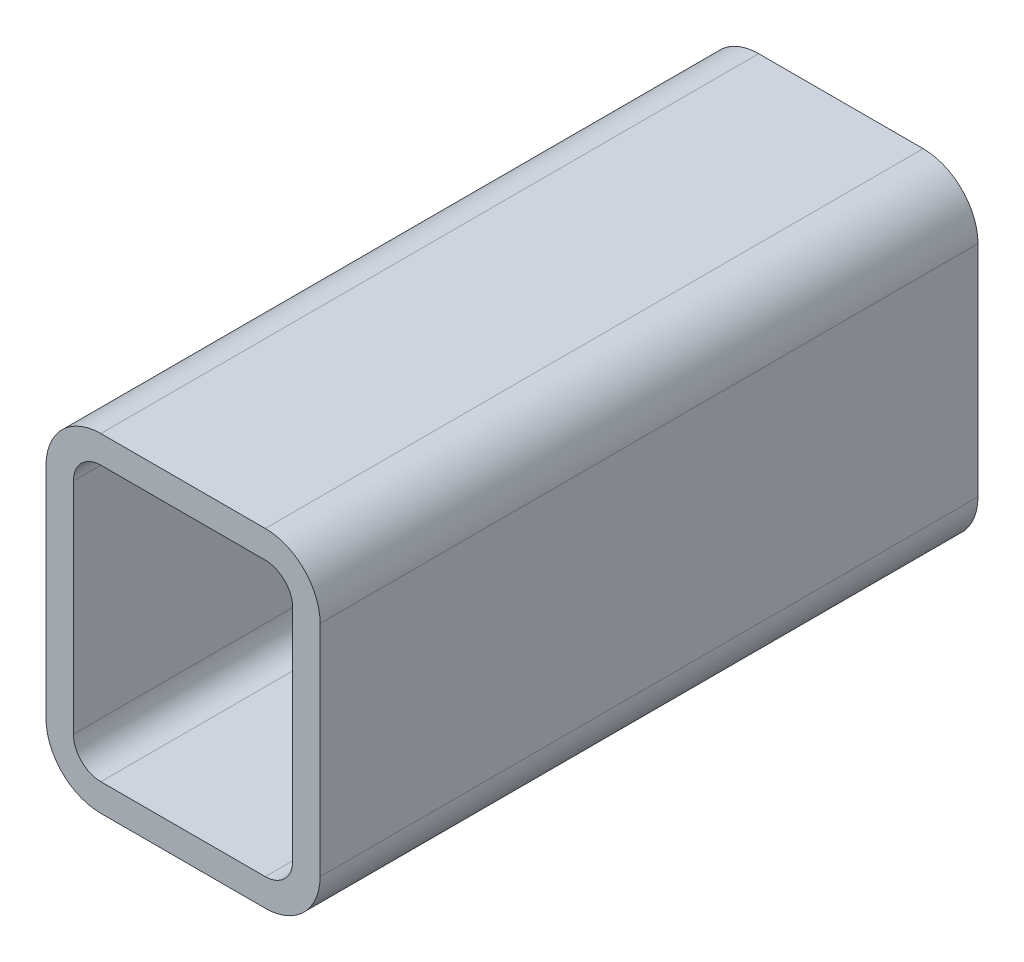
ISO-10303-21;
HEADER;
FILE_DESCRIPTION(('STEP AP214'),'2;1');
FILE_NAME('part.step','',(''),(''),'','','');
FILE_SCHEMA(('AUTOMOTIVE_DESIGN { 1 0 10303 214 1 1 1 1 }'));
ENDSEC;
DATA;
#1=APPLICATION_CONTEXT('core data for automotive mechanical design processes');
#2=APPLICATION_PROTOCOL_DEFINITION('international standard','automotive_design',2000,#1);
#3=PRODUCT_CONTEXT('',#1,'mechanical');
#4=PRODUCT('Part','Part','',(#3));
#5=PRODUCT_RELATED_PRODUCT_CATEGORY('part','',(#4));
#6=PRODUCT_DEFINITION_FORMATION('','',#4);
#7=PRODUCT_DEFINITION_CONTEXT('part definition',#1,'design');
#8=PRODUCT_DEFINITION('design','',#6,#7);
#9=PRODUCT_DEFINITION_SHAPE('','',#8);
#10=(LENGTH_UNIT() NAMED_UNIT(*) SI_UNIT(.MILLI.,.METRE.));
#11=(NAMED_UNIT(*) PLANE_ANGLE_UNIT() SI_UNIT($,.RADIAN.));
#12=(NAMED_UNIT(*) SI_UNIT($,.STERADIAN.) SOLID_ANGLE_UNIT());
#13=UNCERTAINTY_MEASURE_WITH_UNIT(LENGTH_MEASURE(1.E-05),#10,'distance_accuracy_value','');
#14=(GEOMETRIC_REPRESENTATION_CONTEXT(3) GLOBAL_UNCERTAINTY_ASSIGNED_CONTEXT((#13)) GLOBAL_UNIT_ASSIGNED_CONTEXT((#10,
#11,#12)) REPRESENTATION_CONTEXT('',''));
#15=CARTESIAN_POINT('',(0.,0.,0.));
#16=DIRECTION('',(0.,0.,1.));
#17=DIRECTION('',(1.,0.,0.));
#18=AXIS2_PLACEMENT_3D('',#15,#16,#17);
#19=CARTESIAN_POINT('',(26.2612396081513,129.011948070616,304.8));
#20=DIRECTION('',(0.,0.,1.));
#21=DIRECTION('',(1.,0.,0.));
#22=AXIS2_PLACEMENT_3D('',#19,#20,#21);
#23=PLANE('',#22);
#24=CARTESIAN_POINT('',(26.2612396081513,129.011948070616,304.8));
#25=DIRECTION('',(0.,0.,1.));
#26=DIRECTION('',(1.,0.,0.));
#27=AXIS2_PLACEMENT_3D('',#24,#25,#26);
#28=CIRCLE('',#27,25.4);
#29=CARTESIAN_POINT('',(26.2612396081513,154.411948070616,304.8));
#30=VERTEX_POINT('',#29);
#31=CARTESIAN_POINT('',(0.8612396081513,129.011948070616,304.8));
#32=VERTEX_POINT('',#31);
#33=EDGE_CURVE('E211',#30,#32,#28,.T.);
#34=ORIENTED_EDGE('',*,*,#33,.T.);
#35=DIRECTION('',(0.,-1.,0.));
#36=VECTOR('',#35,1.);
#37=CARTESIAN_POINT('',(0.8612396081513,27.4119480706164,304.8));
#38=LINE('',#37,#36);
#39=CARTESIAN_POINT('',(0.861239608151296,27.4119480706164,304.8));
#40=VERTEX_POINT('',#39);
#41=EDGE_CURVE('E214',#32,#40,#38,.T.);
#42=ORIENTED_EDGE('',*,*,#41,.T.);
#43=CARTESIAN_POINT('',(26.2612396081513,27.4119480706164,304.8));
#44=DIRECTION('',(0.,0.,1.));
#45=DIRECTION('',(1.,0.,0.));
#46=AXIS2_PLACEMENT_3D('',#43,#44,#45);
#47=CIRCLE('',#46,25.4);
#48=CARTESIAN_POINT('',(26.2612396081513,2.01194807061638,304.8));
#49=VERTEX_POINT('',#48);
#50=EDGE_CURVE('E217',#40,#49,#47,.T.);
#51=ORIENTED_EDGE('',*,*,#50,.T.);
#52=DIRECTION('',(1.,0.,0.));
#53=VECTOR('',#52,1.);
#54=CARTESIAN_POINT('',(102.461239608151,2.01194807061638,304.8));
#55=LINE('',#54,#53);
#56=CARTESIAN_POINT('',(102.461239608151,2.01194807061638,304.8));
#57=VERTEX_POINT('',#56);
#58=EDGE_CURVE('E219',#49,#57,#55,.T.);
#59=ORIENTED_EDGE('',*,*,#58,.T.);
#60=CARTESIAN_POINT('',(102.461239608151,27.4119480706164,304.8));
#61=DIRECTION('',(0.,0.,1.));
#62=DIRECTION('',(1.,0.,0.));
#63=AXIS2_PLACEMENT_3D('',#60,#61,#62);
#64=CIRCLE('',#63,25.4);
#65=CARTESIAN_POINT('',(127.861239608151,27.4119480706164,304.8));
#66=VERTEX_POINT('',#65);
#67=EDGE_CURVE('E221',#57,#66,#64,.T.);
#68=ORIENTED_EDGE('',*,*,#67,.T.);
#69=DIRECTION('',(0.,1.,0.));
#70=VECTOR('',#69,1.);
#71=CARTESIAN_POINT('',(127.861239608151,129.011948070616,304.8));
#72=LINE('',#71,#70);
#73=CARTESIAN_POINT('',(127.861239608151,129.011948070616,304.8));
#74=VERTEX_POINT('',#73);
#75=EDGE_CURVE('E223',#66,#74,#72,.T.);
#76=ORIENTED_EDGE('',*,*,#75,.T.);
#77=CARTESIAN_POINT('',(102.461239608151,129.011948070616,304.8));
#78=DIRECTION('',(0.,0.,1.));
#79=DIRECTION('',(1.,0.,0.));
#80=AXIS2_PLACEMENT_3D('',#77,#78,#79);
#81=CIRCLE('',#80,25.4);
#82=CARTESIAN_POINT('',(102.461239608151,154.411948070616,304.8));
#83=VERTEX_POINT('',#82);
#84=EDGE_CURVE('E225',#74,#83,#81,.T.);
#85=ORIENTED_EDGE('',*,*,#84,.T.);
#86=DIRECTION('',(-1.,0.,0.));
#87=VECTOR('',#86,1.);
#88=CARTESIAN_POINT('',(26.2612396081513,154.411948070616,304.8));
#89=LINE('',#88,#87);
#90=EDGE_CURVE('E227',#83,#30,#89,.T.);
#91=ORIENTED_EDGE('',*,*,#90,.T.);
#92=EDGE_LOOP('',(#34,#42,#51,#59,#68,#76,#85,#91));
#93=FACE_BOUND('',#92,.T.);
#94=DIRECTION('',(0.,-1.,0.));
#95=VECTOR('',#94,1.);
#96=CARTESIAN_POINT('',(13.5612396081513,27.4119480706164,304.8));
#97=LINE('',#96,#95);
#98=CARTESIAN_POINT('',(13.5612396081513,129.011948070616,304.8));
#99=VERTEX_POINT('',#98);
#100=CARTESIAN_POINT('',(13.5612396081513,27.4119480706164,304.8));
#101=VERTEX_POINT('',#100);
#102=EDGE_CURVE('E154',#99,#101,#97,.T.);
#103=ORIENTED_EDGE('',*,*,#102,.F.);
#104=CARTESIAN_POINT('',(26.2612396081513,129.011948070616,304.8));
#105=DIRECTION('',(0.,0.,1.));
#106=DIRECTION('',(1.,0.,0.));
#107=AXIS2_PLACEMENT_3D('',#104,#105,#106);
#108=CIRCLE('',#107,12.7);
#109=CARTESIAN_POINT('',(26.2612396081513,141.711948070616,304.8));
#110=VERTEX_POINT('',#109);
#111=EDGE_CURVE('E146',#110,#99,#108,.T.);
#112=ORIENTED_EDGE('',*,*,#111,.F.);
#113=DIRECTION('',(-1.,0.,0.));
#114=VECTOR('',#113,1.);
#115=CARTESIAN_POINT('',(26.2612396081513,141.711948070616,304.8));
#116=LINE('',#115,#114);
#117=CARTESIAN_POINT('',(102.461239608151,141.711948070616,304.8));
#118=VERTEX_POINT('',#117);
#119=EDGE_CURVE('E179',#118,#110,#116,.T.);
#120=ORIENTED_EDGE('',*,*,#119,.F.);
#121=CARTESIAN_POINT('',(102.461239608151,129.011948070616,304.8));
#122=DIRECTION('',(0.,0.,1.));
#123=DIRECTION('',(1.,0.,0.));
#124=AXIS2_PLACEMENT_3D('',#121,#122,#123);
#125=CIRCLE('',#124,12.7);
#126=CARTESIAN_POINT('',(115.161239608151,129.011948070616,304.8));
#127=VERTEX_POINT('',#126);
#128=EDGE_CURVE('E177',#127,#118,#125,.T.);
#129=ORIENTED_EDGE('',*,*,#128,.F.);
#130=DIRECTION('',(0.,1.,0.));
#131=VECTOR('',#130,1.);
#132=CARTESIAN_POINT('',(115.161239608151,129.011948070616,304.8));
#133=LINE('',#132,#131);
#134=CARTESIAN_POINT('',(115.161239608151,27.4119480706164,304.8));
#135=VERTEX_POINT('',#134);
#136=EDGE_CURVE('E175',#135,#127,#133,.T.);
#137=ORIENTED_EDGE('',*,*,#136,.F.);
#138=CARTESIAN_POINT('',(102.461239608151,27.4119480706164,304.8));
#139=DIRECTION('',(0.,0.,1.));
#140=DIRECTION('',(1.,0.,0.));
#141=AXIS2_PLACEMENT_3D('',#138,#139,#140);
#142=CIRCLE('',#141,12.7);
#143=CARTESIAN_POINT('',(102.461239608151,14.7119480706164,304.8));
#144=VERTEX_POINT('',#143);
#145=EDGE_CURVE('E173',#144,#135,#142,.T.);
#146=ORIENTED_EDGE('',*,*,#145,.F.);
#147=DIRECTION('',(1.,0.,0.));
#148=VECTOR('',#147,1.);
#149=CARTESIAN_POINT('',(102.461239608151,14.7119480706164,304.8));
#150=LINE('',#149,#148);
#151=CARTESIAN_POINT('',(26.2612396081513,14.7119480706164,304.8));
#152=VERTEX_POINT('',#151);
#153=EDGE_CURVE('E169',#152,#144,#150,.T.);
#154=ORIENTED_EDGE('',*,*,#153,.F.);
#155=CARTESIAN_POINT('',(26.2612396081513,27.4119480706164,304.8));
#156=DIRECTION('',(0.,0.,1.));
#157=DIRECTION('',(1.,0.,0.));
#158=AXIS2_PLACEMENT_3D('',#155,#156,#157);
#159=CIRCLE('',#158,12.7);
#160=EDGE_CURVE('E167',#101,#152,#159,.T.);
#161=ORIENTED_EDGE('',*,*,#160,.F.);
#162=EDGE_LOOP('',(#103,#112,#120,#129,#137,#146,#154,#161));
#163=FACE_BOUND('',#162,.T.);
#164=ADVANCED_FACE('F33',(#93,#163),#23,.T.);
#165=CARTESIAN_POINT('',(26.2612396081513,129.011948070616,0.));
#166=DIRECTION('',(0.,0.,1.));
#167=DIRECTION('',(1.,0.,0.));
#168=AXIS2_PLACEMENT_3D('',#165,#166,#167);
#169=PLANE('',#168);
#170=CARTESIAN_POINT('',(26.2612396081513,129.011948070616,0.));
#171=DIRECTION('',(0.,0.,1.));
#172=DIRECTION('',(1.,0.,0.));
#173=AXIS2_PLACEMENT_3D('',#170,#171,#172);
#174=CIRCLE('',#173,25.4);
#175=CARTESIAN_POINT('',(26.2612396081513,154.411948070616,0.));
#176=VERTEX_POINT('',#175);
#177=CARTESIAN_POINT('',(0.8612396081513,129.011948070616,0.));
#178=VERTEX_POINT('',#177);
#179=EDGE_CURVE('E162',#176,#178,#174,.T.);
#180=ORIENTED_EDGE('',*,*,#179,.F.);
#181=DIRECTION('',(-1.,0.,0.));
#182=VECTOR('',#181,1.);
#183=CARTESIAN_POINT('',(26.2612396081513,154.411948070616,0.));
#184=LINE('',#183,#182);
#185=CARTESIAN_POINT('',(102.461239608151,154.411948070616,0.));
#186=VERTEX_POINT('',#185);
#187=EDGE_CURVE('E215',#186,#176,#184,.T.);
#188=ORIENTED_EDGE('',*,*,#187,.F.);
#189=CARTESIAN_POINT('',(102.461239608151,129.011948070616,0.));
#190=DIRECTION('',(0.,0.,1.));
#191=DIRECTION('',(1.,0.,0.));
#192=AXIS2_PLACEMENT_3D('',#189,#190,#191);
#193=CIRCLE('',#192,25.4);
#194=CARTESIAN_POINT('',(127.861239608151,129.011948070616,0.));
#195=VERTEX_POINT('',#194);
#196=EDGE_CURVE('E242',#195,#186,#193,.T.);
#197=ORIENTED_EDGE('',*,*,#196,.F.);
#198=DIRECTION('',(0.,1.,0.));
#199=VECTOR('',#198,1.);
#200=CARTESIAN_POINT('',(127.861239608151,129.011948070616,0.));
#201=LINE('',#200,#199);
#202=CARTESIAN_POINT('',(127.861239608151,27.4119480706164,0.));
#203=VERTEX_POINT('',#202);
#204=EDGE_CURVE('E240',#203,#195,#201,.T.);
#205=ORIENTED_EDGE('',*,*,#204,.F.);
#206=CARTESIAN_POINT('',(102.461239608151,27.4119480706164,0.));
#207=DIRECTION('',(0.,0.,1.));
#208=DIRECTION('',(1.,0.,0.));
#209=AXIS2_PLACEMENT_3D('',#206,#207,#208);
#210=CIRCLE('',#209,25.4);
#211=CARTESIAN_POINT('',(102.461239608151,2.01194807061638,0.));
#212=VERTEX_POINT('',#211);
#213=EDGE_CURVE('E238',#212,#203,#210,.T.);
#214=ORIENTED_EDGE('',*,*,#213,.F.);
#215=DIRECTION('',(1.,0.,0.));
#216=VECTOR('',#215,1.);
#217=CARTESIAN_POINT('',(102.461239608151,2.01194807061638,0.));
#218=LINE('',#217,#216);
#219=CARTESIAN_POINT('',(26.2612396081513,2.01194807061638,0.));
#220=VERTEX_POINT('',#219);
#221=EDGE_CURVE('E236',#220,#212,#218,.T.);
#222=ORIENTED_EDGE('',*,*,#221,.F.);
#223=CARTESIAN_POINT('',(26.2612396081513,27.4119480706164,0.));
#224=DIRECTION('',(0.,0.,1.));
#225=DIRECTION('',(1.,0.,0.));
#226=AXIS2_PLACEMENT_3D('',#223,#224,#225);
#227=CIRCLE('',#226,25.4);
#228=CARTESIAN_POINT('',(0.861239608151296,27.4119480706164,0.));
#229=VERTEX_POINT('',#228);
#230=EDGE_CURVE('E234',#229,#220,#227,.T.);
#231=ORIENTED_EDGE('',*,*,#230,.F.);
#232=DIRECTION('',(0.,-1.,0.));
#233=VECTOR('',#232,1.);
#234=CARTESIAN_POINT('',(0.8612396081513,27.4119480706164,0.));
#235=LINE('',#234,#233);
#236=EDGE_CURVE('E232',#178,#229,#235,.T.);
#237=ORIENTED_EDGE('',*,*,#236,.F.);
#238=EDGE_LOOP('',(#180,#188,#197,#205,#214,#222,#231,#237));
#239=FACE_BOUND('',#238,.T.);
#240=CARTESIAN_POINT('',(26.2612396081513,129.011948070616,0.));
#241=DIRECTION('',(0.,0.,1.));
#242=DIRECTION('',(1.,0.,0.));
#243=AXIS2_PLACEMENT_3D('',#240,#241,#242);
#244=CIRCLE('',#243,12.7);
#245=CARTESIAN_POINT('',(26.2612396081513,141.711948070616,0.));
#246=VERTEX_POINT('',#245);
#247=CARTESIAN_POINT('',(13.5612396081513,129.011948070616,0.));
#248=VERTEX_POINT('',#247);
#249=EDGE_CURVE('E56',#246,#248,#244,.T.);
#250=ORIENTED_EDGE('',*,*,#249,.T.);
#251=DIRECTION('',(0.,-1.,0.));
#252=VECTOR('',#251,1.);
#253=CARTESIAN_POINT('',(13.5612396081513,27.4119480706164,0.));
#254=LINE('',#253,#252);
#255=CARTESIAN_POINT('',(13.5612396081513,27.4119480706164,0.));
#256=VERTEX_POINT('',#255);
#257=EDGE_CURVE('E161',#248,#256,#254,.T.);
#258=ORIENTED_EDGE('',*,*,#257,.T.);
#259=CARTESIAN_POINT('',(26.2612396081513,27.4119480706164,0.));
#260=DIRECTION('',(0.,0.,1.));
#261=DIRECTION('',(1.,0.,0.));
#262=AXIS2_PLACEMENT_3D('',#259,#260,#261);
#263=CIRCLE('',#262,12.7);
#264=CARTESIAN_POINT('',(26.2612396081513,14.7119480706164,0.));
#265=VERTEX_POINT('',#264);
#266=EDGE_CURVE('E183',#256,#265,#263,.T.);
#267=ORIENTED_EDGE('',*,*,#266,.T.);
#268=DIRECTION('',(1.,0.,0.));
#269=VECTOR('',#268,1.);
#270=CARTESIAN_POINT('',(102.461239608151,14.7119480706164,0.));
#271=LINE('',#270,#269);
#272=CARTESIAN_POINT('',(102.461239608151,14.7119480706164,0.));
#273=VERTEX_POINT('',#272);
#274=EDGE_CURVE('E186',#265,#273,#271,.T.);
#275=ORIENTED_EDGE('',*,*,#274,.T.);
#276=CARTESIAN_POINT('',(102.461239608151,27.4119480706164,0.));
#277=DIRECTION('',(0.,0.,1.));
#278=DIRECTION('',(1.,0.,0.));
#279=AXIS2_PLACEMENT_3D('',#276,#277,#278);
#280=CIRCLE('',#279,12.7);
#281=CARTESIAN_POINT('',(115.161239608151,27.4119480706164,0.));
#282=VERTEX_POINT('',#281);
#283=EDGE_CURVE('E189',#273,#282,#280,.T.);
#284=ORIENTED_EDGE('',*,*,#283,.T.);
#285=DIRECTION('',(0.,1.,0.));
#286=VECTOR('',#285,1.);
#287=CARTESIAN_POINT('',(115.161239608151,129.011948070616,0.));
#288=LINE('',#287,#286);
#289=CARTESIAN_POINT('',(115.161239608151,129.011948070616,0.));
#290=VERTEX_POINT('',#289);
#291=EDGE_CURVE('E192',#282,#290,#288,.T.);
#292=ORIENTED_EDGE('',*,*,#291,.T.);
#293=CARTESIAN_POINT('',(102.461239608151,129.011948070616,0.));
#294=DIRECTION('',(0.,0.,1.));
#295=DIRECTION('',(1.,0.,0.));
#296=AXIS2_PLACEMENT_3D('',#293,#294,#295);
#297=CIRCLE('',#296,12.7);
#298=CARTESIAN_POINT('',(102.461239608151,141.711948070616,0.));
#299=VERTEX_POINT('',#298);
#300=EDGE_CURVE('E195',#290,#299,#297,.T.);
#301=ORIENTED_EDGE('',*,*,#300,.T.);
#302=DIRECTION('',(-1.,0.,0.));
#303=VECTOR('',#302,1.);
#304=CARTESIAN_POINT('',(26.2612396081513,141.711948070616,0.));
#305=LINE('',#304,#303);
#306=EDGE_CURVE('E155',#299,#246,#305,.T.);
#307=ORIENTED_EDGE('',*,*,#306,.T.);
#308=EDGE_LOOP('',(#250,#258,#267,#275,#284,#292,#301,#307));
#309=FACE_BOUND('',#308,.T.);
#310=ADVANCED_FACE('F272',(#239,#309),#169,.F.);
#311=CARTESIAN_POINT('',(26.2612396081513,129.011948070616,304.8));
#312=DIRECTION('',(0.,0.,-1.));
#313=DIRECTION('',(-1.,0.,0.));
#314=AXIS2_PLACEMENT_3D('',#311,#312,#313);
#315=CYLINDRICAL_SURFACE('',#314,25.4);
#316=ORIENTED_EDGE('',*,*,#179,.T.);
#317=DIRECTION('',(0.,0.,-1.));
#318=VECTOR('',#317,1.);
#319=CARTESIAN_POINT('',(0.8612396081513,129.011948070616,304.8));
#320=LINE('',#319,#318);
#321=EDGE_CURVE('E11',#32,#178,#320,.T.);
#322=ORIENTED_EDGE('',*,*,#321,.F.);
#323=ORIENTED_EDGE('',*,*,#33,.F.);
#324=DIRECTION('',(0.,0.,-1.));
#325=VECTOR('',#324,1.);
#326=CARTESIAN_POINT('',(26.2612396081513,154.411948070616,304.8));
#327=LINE('',#326,#325);
#328=EDGE_CURVE('E229',#30,#176,#327,.T.);
#329=ORIENTED_EDGE('',*,*,#328,.T.);
#330=EDGE_LOOP('',(#316,#322,#323,#329));
#331=FACE_BOUND('',#330,.T.);
#332=ADVANCED_FACE('F35',(#331),#315,.T.);
#333=CARTESIAN_POINT('',(0.8612396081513,27.4119480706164,304.8));
#334=DIRECTION('',(1.,0.,0.));
#335=DIRECTION('',(0.,0.,-1.));
#336=AXIS2_PLACEMENT_3D('',#333,#334,#335);
#337=PLANE('',#336);
#338=ORIENTED_EDGE('',*,*,#236,.T.);
#339=DIRECTION('',(0.,0.,-1.));
#340=VECTOR('',#339,1.);
#341=CARTESIAN_POINT('',(0.861239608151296,27.4119480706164,304.8));
#342=LINE('',#341,#340);
#343=EDGE_CURVE('E41',#40,#229,#342,.T.);
#344=ORIENTED_EDGE('',*,*,#343,.F.);
#345=ORIENTED_EDGE('',*,*,#41,.F.);
#346=ORIENTED_EDGE('',*,*,#321,.T.);
#347=EDGE_LOOP('',(#338,#344,#345,#346));
#348=FACE_BOUND('',#347,.T.);
#349=ADVANCED_FACE('F289',(#348),#337,.F.);
#350=CARTESIAN_POINT('',(26.2612396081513,27.4119480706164,304.8));
#351=DIRECTION('',(0.,0.,-1.));
#352=DIRECTION('',(-1.,0.,0.));
#353=AXIS2_PLACEMENT_3D('',#350,#351,#352);
#354=CYLINDRICAL_SURFACE('',#353,25.4);
#355=ORIENTED_EDGE('',*,*,#230,.T.);
#356=DIRECTION('',(0.,0.,-1.));
#357=VECTOR('',#356,1.);
#358=CARTESIAN_POINT('',(26.2612396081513,2.01194807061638,304.8));
#359=LINE('',#358,#357);
#360=EDGE_CURVE('E259',#49,#220,#359,.T.);
#361=ORIENTED_EDGE('',*,*,#360,.F.);
#362=ORIENTED_EDGE('',*,*,#50,.F.);
#363=ORIENTED_EDGE('',*,*,#343,.T.);
#364=EDGE_LOOP('',(#355,#361,#362,#363));
#365=FACE_BOUND('',#364,.T.);
#366=ADVANCED_FACE('F266',(#365),#354,.T.);
#367=CARTESIAN_POINT('',(102.461239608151,2.01194807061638,304.8));
#368=DIRECTION('',(0.,1.,0.));
#369=DIRECTION('',(0.,0.,1.));
#370=AXIS2_PLACEMENT_3D('',#367,#368,#369);
#371=PLANE('',#370);
#372=ORIENTED_EDGE('',*,*,#221,.T.);
#373=DIRECTION('',(0.,0.,-1.));
#374=VECTOR('',#373,1.);
#375=CARTESIAN_POINT('',(102.461239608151,2.01194807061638,304.8));
#376=LINE('',#375,#374);
#377=EDGE_CURVE('E256',#57,#212,#376,.T.);
#378=ORIENTED_EDGE('',*,*,#377,.F.);
#379=ORIENTED_EDGE('',*,*,#58,.F.);
#380=ORIENTED_EDGE('',*,*,#360,.T.);
#381=EDGE_LOOP('',(#372,#378,#379,#380));
#382=FACE_BOUND('',#381,.T.);
#383=ADVANCED_FACE('F278',(#382),#371,.F.);
#384=CARTESIAN_POINT('',(102.461239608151,27.4119480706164,304.8));
#385=DIRECTION('',(0.,0.,-1.));
#386=DIRECTION('',(-1.,0.,0.));
#387=AXIS2_PLACEMENT_3D('',#384,#385,#386);
#388=CYLINDRICAL_SURFACE('',#387,25.4);
#389=ORIENTED_EDGE('',*,*,#213,.T.);
#390=DIRECTION('',(0.,0.,-1.));
#391=VECTOR('',#390,1.);
#392=CARTESIAN_POINT('',(127.861239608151,27.4119480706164,304.8));
#393=LINE('',#392,#391);
#394=EDGE_CURVE('E253',#66,#203,#393,.T.);
#395=ORIENTED_EDGE('',*,*,#394,.F.);
#396=ORIENTED_EDGE('',*,*,#67,.F.);
#397=ORIENTED_EDGE('',*,*,#377,.T.);
#398=EDGE_LOOP('',(#389,#395,#396,#397));
#399=FACE_BOUND('',#398,.T.);
#400=ADVANCED_FACE('F282',(#399),#388,.T.);
#401=CARTESIAN_POINT('',(127.861239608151,129.011948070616,304.8));
#402=DIRECTION('',(-1.,0.,0.));
#403=DIRECTION('',(0.,0.,1.));
#404=AXIS2_PLACEMENT_3D('',#401,#402,#403);
#405=PLANE('',#404);
#406=ORIENTED_EDGE('',*,*,#204,.T.);
#407=DIRECTION('',(0.,0.,-1.));
#408=VECTOR('',#407,1.);
#409=CARTESIAN_POINT('',(127.861239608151,129.011948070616,304.8));
#410=LINE('',#409,#408);
#411=EDGE_CURVE('E250',#74,#195,#410,.T.);
#412=ORIENTED_EDGE('',*,*,#411,.F.);
#413=ORIENTED_EDGE('',*,*,#75,.F.);
#414=ORIENTED_EDGE('',*,*,#394,.T.);
#415=EDGE_LOOP('',(#406,#412,#413,#414));
#416=FACE_BOUND('',#415,.T.);
#417=ADVANCED_FACE('F302',(#416),#405,.F.);
#418=CARTESIAN_POINT('',(102.461239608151,129.011948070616,304.8));
#419=DIRECTION('',(0.,0.,-1.));
#420=DIRECTION('',(-1.,0.,0.));
#421=AXIS2_PLACEMENT_3D('',#418,#419,#420);
#422=CYLINDRICAL_SURFACE('',#421,25.4);
#423=ORIENTED_EDGE('',*,*,#196,.T.);
#424=DIRECTION('',(0.,0.,-1.));
#425=VECTOR('',#424,1.);
#426=CARTESIAN_POINT('',(102.461239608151,154.411948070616,304.8));
#427=LINE('',#426,#425);
#428=EDGE_CURVE('E247',#83,#186,#427,.T.);
#429=ORIENTED_EDGE('',*,*,#428,.F.);
#430=ORIENTED_EDGE('',*,*,#84,.F.);
#431=ORIENTED_EDGE('',*,*,#411,.T.);
#432=EDGE_LOOP('',(#423,#429,#430,#431));
#433=FACE_BOUND('',#432,.T.);
#434=ADVANCED_FACE('F300',(#433),#422,.T.);
#435=CARTESIAN_POINT('',(26.2612396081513,154.411948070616,304.8));
#436=DIRECTION('',(0.,-1.,0.));
#437=DIRECTION('',(0.,0.,-1.));
#438=AXIS2_PLACEMENT_3D('',#435,#436,#437);
#439=PLANE('',#438);
#440=ORIENTED_EDGE('',*,*,#187,.T.);
#441=ORIENTED_EDGE('',*,*,#328,.F.);
#442=ORIENTED_EDGE('',*,*,#90,.F.);
#443=ORIENTED_EDGE('',*,*,#428,.T.);
#444=EDGE_LOOP('',(#440,#441,#442,#443));
#445=FACE_BOUND('',#444,.T.);
#446=ADVANCED_FACE('F295',(#445),#439,.F.);
#447=CARTESIAN_POINT('',(26.2612396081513,129.011948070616,304.8));
#448=DIRECTION('',(0.,0.,-1.));
#449=DIRECTION('',(-1.,0.,0.));
#450=AXIS2_PLACEMENT_3D('',#447,#448,#449);
#451=CYLINDRICAL_SURFACE('',#450,12.7);
#452=ORIENTED_EDGE('',*,*,#249,.F.);
#453=DIRECTION('',(0.,0.,-1.));
#454=VECTOR('',#453,1.);
#455=CARTESIAN_POINT('',(26.2612396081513,141.711948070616,304.8));
#456=LINE('',#455,#454);
#457=EDGE_CURVE('E150',#110,#246,#456,.T.);
#458=ORIENTED_EDGE('',*,*,#457,.F.);
#459=ORIENTED_EDGE('',*,*,#111,.T.);
#460=DIRECTION('',(0.,0.,-1.));
#461=VECTOR('',#460,1.);
#462=CARTESIAN_POINT('',(13.5612396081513,129.011948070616,304.8));
#463=LINE('',#462,#461);
#464=EDGE_CURVE('E149',#99,#248,#463,.T.);
#465=ORIENTED_EDGE('',*,*,#464,.T.);
#466=EDGE_LOOP('',(#452,#458,#459,#465));
#467=FACE_BOUND('',#466,.T.);
#468=ADVANCED_FACE('F148',(#467),#451,.F.);
#469=CARTESIAN_POINT('',(13.5612396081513,27.4119480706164,304.8));
#470=DIRECTION('',(1.,0.,0.));
#471=DIRECTION('',(0.,0.,-1.));
#472=AXIS2_PLACEMENT_3D('',#469,#470,#471);
#473=PLANE('',#472);
#474=ORIENTED_EDGE('',*,*,#257,.F.);
#475=ORIENTED_EDGE('',*,*,#464,.F.);
#476=ORIENTED_EDGE('',*,*,#102,.T.);
#477=DIRECTION('',(0.,0.,-1.));
#478=VECTOR('',#477,1.);
#479=CARTESIAN_POINT('',(13.5612396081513,27.4119480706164,304.8));
#480=LINE('',#479,#478);
#481=EDGE_CURVE('E163',#101,#256,#480,.T.);
#482=ORIENTED_EDGE('',*,*,#481,.T.);
#483=EDGE_LOOP('',(#474,#475,#476,#482));
#484=FACE_BOUND('',#483,.T.);
#485=ADVANCED_FACE('F158',(#484),#473,.T.);
#486=CARTESIAN_POINT('',(26.2612396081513,27.4119480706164,304.8));
#487=DIRECTION('',(0.,0.,-1.));
#488=DIRECTION('',(-1.,0.,0.));
#489=AXIS2_PLACEMENT_3D('',#486,#487,#488);
#490=CYLINDRICAL_SURFACE('',#489,12.7);
#491=ORIENTED_EDGE('',*,*,#266,.F.);
#492=ORIENTED_EDGE('',*,*,#481,.F.);
#493=ORIENTED_EDGE('',*,*,#160,.T.);
#494=DIRECTION('',(0.,0.,-1.));
#495=VECTOR('',#494,1.);
#496=CARTESIAN_POINT('',(26.2612396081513,14.7119480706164,304.8));
#497=LINE('',#496,#495);
#498=EDGE_CURVE('E208',#152,#265,#497,.T.);
#499=ORIENTED_EDGE('',*,*,#498,.T.);
#500=EDGE_LOOP('',(#491,#492,#493,#499));
#501=FACE_BOUND('',#500,.T.);
#502=ADVANCED_FACE('F327',(#501),#490,.F.);
#503=CARTESIAN_POINT('',(102.461239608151,14.7119480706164,304.8));
#504=DIRECTION('',(0.,1.,0.));
#505=DIRECTION('',(0.,0.,1.));
#506=AXIS2_PLACEMENT_3D('',#503,#504,#505);
#507=PLANE('',#506);
#508=ORIENTED_EDGE('',*,*,#274,.F.);
#509=ORIENTED_EDGE('',*,*,#498,.F.);
#510=ORIENTED_EDGE('',*,*,#153,.T.);
#511=DIRECTION('',(0.,0.,-1.));
#512=VECTOR('',#511,1.);
#513=CARTESIAN_POINT('',(102.461239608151,14.7119480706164,304.8));
#514=LINE('',#513,#512);
#515=EDGE_CURVE('E206',#144,#273,#514,.T.);
#516=ORIENTED_EDGE('',*,*,#515,.T.);
#517=EDGE_LOOP('',(#508,#509,#510,#516));
#518=FACE_BOUND('',#517,.T.);
#519=ADVANCED_FACE('F331',(#518),#507,.T.);
#520=CARTESIAN_POINT('',(102.461239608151,27.4119480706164,304.8));
#521=DIRECTION('',(0.,0.,-1.));
#522=DIRECTION('',(-1.,0.,0.));
#523=AXIS2_PLACEMENT_3D('',#520,#521,#522);
#524=CYLINDRICAL_SURFACE('',#523,12.7);
#525=ORIENTED_EDGE('',*,*,#283,.F.);
#526=ORIENTED_EDGE('',*,*,#515,.F.);
#527=ORIENTED_EDGE('',*,*,#145,.T.);
#528=DIRECTION('',(0.,0.,-1.));
#529=VECTOR('',#528,1.);
#530=CARTESIAN_POINT('',(115.161239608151,27.4119480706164,304.8));
#531=LINE('',#530,#529);
#532=EDGE_CURVE('E204',#135,#282,#531,.T.);
#533=ORIENTED_EDGE('',*,*,#532,.T.);
#534=EDGE_LOOP('',(#525,#526,#527,#533));
#535=FACE_BOUND('',#534,.T.);
#536=ADVANCED_FACE('F337',(#535),#524,.F.);
#537=CARTESIAN_POINT('',(115.161239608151,129.011948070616,304.8));
#538=DIRECTION('',(-1.,0.,0.));
#539=DIRECTION('',(0.,0.,1.));
#540=AXIS2_PLACEMENT_3D('',#537,#538,#539);
#541=PLANE('',#540);
#542=ORIENTED_EDGE('',*,*,#291,.F.);
#543=ORIENTED_EDGE('',*,*,#532,.F.);
#544=ORIENTED_EDGE('',*,*,#136,.T.);
#545=DIRECTION('',(0.,0.,-1.));
#546=VECTOR('',#545,1.);
#547=CARTESIAN_POINT('',(115.161239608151,129.011948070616,304.8));
#548=LINE('',#547,#546);
#549=EDGE_CURVE('E202',#127,#290,#548,.T.);
#550=ORIENTED_EDGE('',*,*,#549,.T.);
#551=EDGE_LOOP('',(#542,#543,#544,#550));
#552=FACE_BOUND('',#551,.T.);
#553=ADVANCED_FACE('F341',(#552),#541,.T.);
#554=CARTESIAN_POINT('',(102.461239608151,129.011948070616,304.8));
#555=DIRECTION('',(0.,0.,-1.));
#556=DIRECTION('',(-1.,0.,0.));
#557=AXIS2_PLACEMENT_3D('',#554,#555,#556);
#558=CYLINDRICAL_SURFACE('',#557,12.7);
#559=ORIENTED_EDGE('',*,*,#300,.F.);
#560=ORIENTED_EDGE('',*,*,#549,.F.);
#561=ORIENTED_EDGE('',*,*,#128,.T.);
#562=DIRECTION('',(0.,0.,-1.));
#563=VECTOR('',#562,1.);
#564=CARTESIAN_POINT('',(102.461239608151,141.711948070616,304.8));
#565=LINE('',#564,#563);
#566=EDGE_CURVE('E48',#118,#299,#565,.T.);
#567=ORIENTED_EDGE('',*,*,#566,.T.);
#568=EDGE_LOOP('',(#559,#560,#561,#567));
#569=FACE_BOUND('',#568,.T.);
#570=ADVANCED_FACE('F345',(#569),#558,.F.);
#571=CARTESIAN_POINT('',(26.2612396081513,141.711948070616,304.8));
#572=DIRECTION('',(0.,-1.,0.));
#573=DIRECTION('',(0.,0.,-1.));
#574=AXIS2_PLACEMENT_3D('',#571,#572,#573);
#575=PLANE('',#574);
#576=ORIENTED_EDGE('',*,*,#306,.F.);
#577=ORIENTED_EDGE('',*,*,#566,.F.);
#578=ORIENTED_EDGE('',*,*,#119,.T.);
#579=ORIENTED_EDGE('',*,*,#457,.T.);
#580=EDGE_LOOP('',(#576,#577,#578,#579));
#581=FACE_BOUND('',#580,.T.);
#582=ADVANCED_FACE('F349',(#581),#575,.T.);
#583=CLOSED_SHELL('',(#164,#310,#332,#349,#366,#383,#400,#417,#434,#446,#468,#485,#502,#519,
#536,#553,#570,#582));
#584=MANIFOLD_SOLID_BREP('B2',#583);
#585=ADVANCED_BREP_SHAPE_REPRESENTATION('',(#18,#584),#14);
#586=SHAPE_DEFINITION_REPRESENTATION(#9,#585);
ENDSEC;
END-ISO-10303-21;
